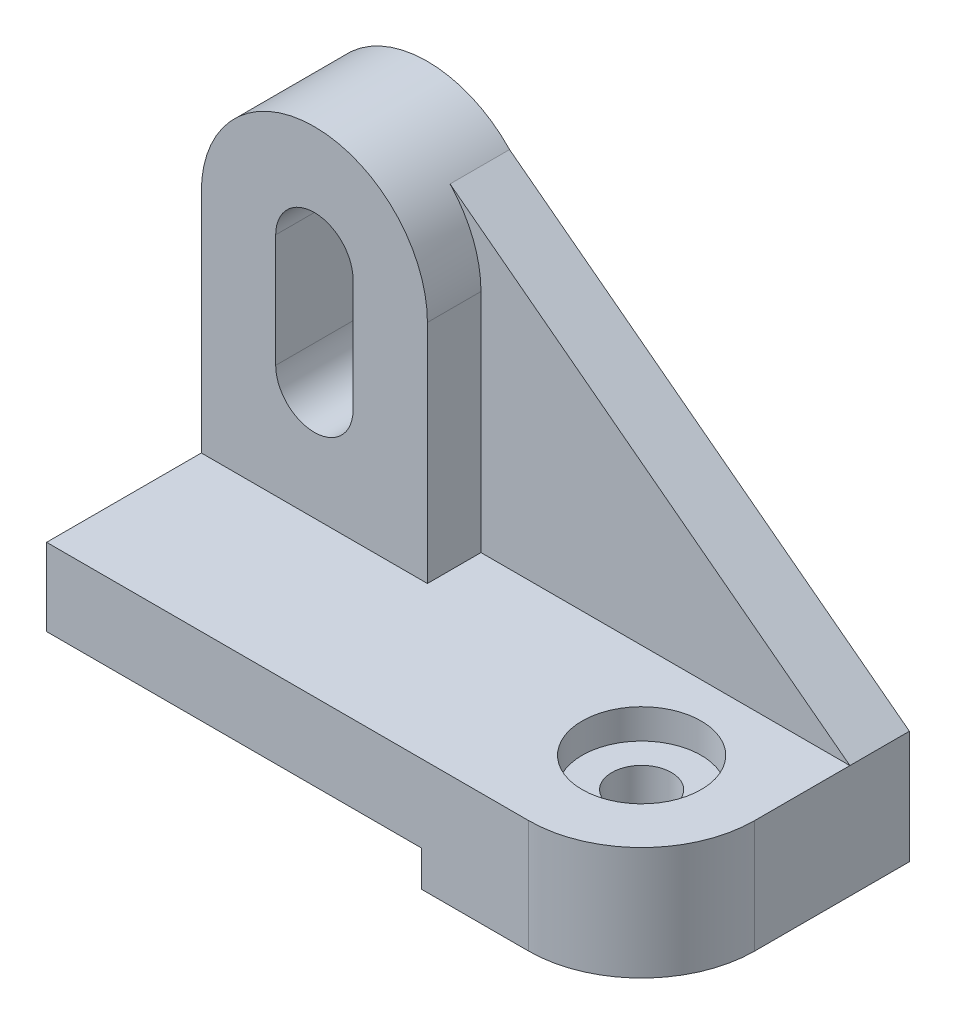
ISO-10303-21;
HEADER;
FILE_DESCRIPTION(('STEP AP214'),'2;1');
FILE_NAME('part.step','',(''),(''),'','','');
FILE_SCHEMA(('AUTOMOTIVE_DESIGN { 1 0 10303 214 1 1 1 1 }'));
ENDSEC;
DATA;
#1=APPLICATION_CONTEXT('core data for automotive mechanical design processes');
#2=APPLICATION_PROTOCOL_DEFINITION('international standard','automotive_design',2000,#1);
#3=PRODUCT_CONTEXT('',#1,'mechanical');
#4=PRODUCT('Part','Part','',(#3));
#5=PRODUCT_RELATED_PRODUCT_CATEGORY('part','',(#4));
#6=PRODUCT_DEFINITION_FORMATION('','',#4);
#7=PRODUCT_DEFINITION_CONTEXT('part definition',#1,'design');
#8=PRODUCT_DEFINITION('design','',#6,#7);
#9=PRODUCT_DEFINITION_SHAPE('','',#8);
#10=(LENGTH_UNIT() NAMED_UNIT(*) SI_UNIT(.MILLI.,.METRE.));
#11=(NAMED_UNIT(*) PLANE_ANGLE_UNIT() SI_UNIT($,.RADIAN.));
#12=(NAMED_UNIT(*) SI_UNIT($,.STERADIAN.) SOLID_ANGLE_UNIT());
#13=UNCERTAINTY_MEASURE_WITH_UNIT(LENGTH_MEASURE(1.E-05),#10,'distance_accuracy_value','');
#14=(GEOMETRIC_REPRESENTATION_CONTEXT(3) GLOBAL_UNCERTAINTY_ASSIGNED_CONTEXT((#13)) GLOBAL_UNIT_ASSIGNED_CONTEXT((#10,
#11,#12)) REPRESENTATION_CONTEXT('',''));
#15=CARTESIAN_POINT('',(0.,0.,0.));
#16=DIRECTION('',(0.,0.,1.));
#17=DIRECTION('',(1.,0.,0.));
#18=AXIS2_PLACEMENT_3D('',#15,#16,#17);
#19=CARTESIAN_POINT('',(0.,130.,450.));
#20=DIRECTION('',(0.,-1.,0.));
#21=DIRECTION('',(0.,0.,-1.));
#22=AXIS2_PLACEMENT_3D('',#19,#20,#21);
#23=PLANE('',#22);
#24=CARTESIAN_POINT('',(810.,130.,260.));
#25=DIRECTION('',(0.,1.,0.));
#26=DIRECTION('',(0.,0.,1.));
#27=AXIS2_PLACEMENT_3D('',#24,#25,#26);
#28=CIRCLE('',#27,100.);
#29=CARTESIAN_POINT('',(810.,130.,360.));
#30=VERTEX_POINT('',#29);
#31=EDGE_CURVE('E303',#30,#30,#28,.T.);
#32=ORIENTED_EDGE('',*,*,#31,.F.);
#33=EDGE_LOOP('',(#32));
#34=FACE_BOUND('',#33,.T.);
#35=DIRECTION('',(1.,0.,0.));
#36=VECTOR('',#35,1.);
#37=CARTESIAN_POINT('',(0.,130.,100.));
#38=LINE('',#37,#36);
#39=CARTESIAN_POINT('',(380.,130.,100.));
#40=VERTEX_POINT('',#39);
#41=CARTESIAN_POINT('',(1000.,130.,100.));
#42=VERTEX_POINT('',#41);
#43=EDGE_CURVE('E156',#40,#42,#38,.T.);
#44=ORIENTED_EDGE('',*,*,#43,.F.);
#45=DIRECTION('',(0.,0.,-1.));
#46=VECTOR('',#45,1.);
#47=CARTESIAN_POINT('',(380.,130.,190.));
#48=LINE('',#47,#46);
#49=CARTESIAN_POINT('',(380.,130.,190.));
#50=VERTEX_POINT('',#49);
#51=EDGE_CURVE('E221',#50,#40,#48,.T.);
#52=ORIENTED_EDGE('',*,*,#51,.F.);
#53=DIRECTION('',(1.,0.,0.));
#54=VECTOR('',#53,1.);
#55=CARTESIAN_POINT('',(0.,130.,190.));
#56=LINE('',#55,#54);
#57=CARTESIAN_POINT('',(0.,130.,190.));
#58=VERTEX_POINT('',#57);
#59=EDGE_CURVE('E70',#58,#50,#56,.T.);
#60=ORIENTED_EDGE('',*,*,#59,.F.);
#61=DIRECTION('',(0.,0.,-1.));
#62=VECTOR('',#61,1.);
#63=CARTESIAN_POINT('',(0.,130.,450.));
#64=LINE('',#63,#62);
#65=CARTESIAN_POINT('',(0.,130.,450.));
#66=VERTEX_POINT('',#65);
#67=EDGE_CURVE('E190',#66,#58,#64,.T.);
#68=ORIENTED_EDGE('',*,*,#67,.F.);
#69=DIRECTION('',(-1.,0.,0.));
#70=VECTOR('',#69,1.);
#71=CARTESIAN_POINT('',(0.,130.,450.));
#72=LINE('',#71,#70);
#73=CARTESIAN_POINT('',(810.,130.,450.));
#74=VERTEX_POINT('',#73);
#75=EDGE_CURVE('E324',#74,#66,#72,.T.);
#76=ORIENTED_EDGE('',*,*,#75,.F.);
#77=CARTESIAN_POINT('',(810.,130.,260.));
#78=DIRECTION('',(0.,-1.,0.));
#79=DIRECTION('',(0.,0.,-1.));
#80=AXIS2_PLACEMENT_3D('',#77,#78,#79);
#81=CIRCLE('',#80,190.);
#82=CARTESIAN_POINT('',(1000.,130.,260.));
#83=VERTEX_POINT('',#82);
#84=EDGE_CURVE('E187',#74,#83,#81,.F.);
#85=ORIENTED_EDGE('',*,*,#84,.T.);
#86=DIRECTION('',(0.,0.,-1.));
#87=VECTOR('',#86,1.);
#88=CARTESIAN_POINT('',(1000.,130.,450.));
#89=LINE('',#88,#87);
#90=EDGE_CURVE('E179',#83,#42,#89,.T.);
#91=ORIENTED_EDGE('',*,*,#90,.T.);
#92=EDGE_LOOP('',(#44,#52,#60,#68,#76,#85,#91));
#93=FACE_BOUND('',#92,.T.);
#94=ADVANCED_FACE('F47',(#34,#93),#23,.F.);
#95=CARTESIAN_POINT('',(380.,0.,190.));
#96=DIRECTION('',(-1.,0.,0.));
#97=DIRECTION('',(0.,0.,1.));
#98=AXIS2_PLACEMENT_3D('',#95,#96,#97);
#99=PLANE('',#98);
#100=DIRECTION('',(0.,-1.,0.));
#101=VECTOR('',#100,1.);
#102=CARTESIAN_POINT('',(380.,0.,100.));
#103=LINE('',#102,#101);
#104=CARTESIAN_POINT('',(380.,510.,100.));
#105=VERTEX_POINT('',#104);
#106=EDGE_CURVE('E159',#105,#40,#103,.T.);
#107=ORIENTED_EDGE('',*,*,#106,.F.);
#108=DIRECTION('',(0.,0.,-1.));
#109=VECTOR('',#108,1.);
#110=CARTESIAN_POINT('',(380.,510.,190.));
#111=LINE('',#110,#109);
#112=CARTESIAN_POINT('',(380.,510.,190.));
#113=VERTEX_POINT('',#112);
#114=EDGE_CURVE('E229',#113,#105,#111,.T.);
#115=ORIENTED_EDGE('',*,*,#114,.F.);
#116=DIRECTION('',(0.,1.,0.));
#117=VECTOR('',#116,1.);
#118=CARTESIAN_POINT('',(380.,0.,190.));
#119=LINE('',#118,#117);
#120=EDGE_CURVE('E259',#50,#113,#119,.T.);
#121=ORIENTED_EDGE('',*,*,#120,.F.);
#122=ORIENTED_EDGE('',*,*,#51,.T.);
#123=EDGE_LOOP('',(#107,#115,#121,#122));
#124=FACE_BOUND('',#123,.T.);
#125=ADVANCED_FACE('F231',(#124),#99,.F.);
#126=CARTESIAN_POINT('',(630.,0.,450.));
#127=DIRECTION('',(0.,1.,0.));
#128=DIRECTION('',(-1.,0.,0.));
#129=AXIS2_PLACEMENT_3D('',#126,#127,#128);
#130=PLANE('',#129);
#131=DIRECTION('',(1.,0.,0.));
#132=VECTOR('',#131,1.);
#133=CARTESIAN_POINT('',(630.,0.,0.));
#134=LINE('',#133,#132);
#135=CARTESIAN_POINT('',(0.,0.,0.));
#136=VERTEX_POINT('',#135);
#137=CARTESIAN_POINT('',(630.,0.,0.));
#138=VERTEX_POINT('',#137);
#139=EDGE_CURVE('E308',#136,#138,#134,.T.);
#140=ORIENTED_EDGE('',*,*,#139,.T.);
#141=DIRECTION('',(0.,0.,-1.));
#142=VECTOR('',#141,1.);
#143=CARTESIAN_POINT('',(630.,0.,450.));
#144=LINE('',#143,#142);
#145=CARTESIAN_POINT('',(630.,0.,450.));
#146=VERTEX_POINT('',#145);
#147=EDGE_CURVE('E202',#146,#138,#144,.T.);
#148=ORIENTED_EDGE('',*,*,#147,.F.);
#149=DIRECTION('',(1.,0.,0.));
#150=VECTOR('',#149,1.);
#151=CARTESIAN_POINT('',(630.,0.,450.));
#152=LINE('',#151,#150);
#153=CARTESIAN_POINT('',(0.,0.,450.));
#154=VERTEX_POINT('',#153);
#155=EDGE_CURVE('E312',#154,#146,#152,.T.);
#156=ORIENTED_EDGE('',*,*,#155,.F.);
#157=DIRECTION('',(0.,0.,-1.));
#158=VECTOR('',#157,1.);
#159=CARTESIAN_POINT('',(0.,0.,450.));
#160=LINE('',#159,#158);
#161=EDGE_CURVE('E196',#154,#136,#160,.T.);
#162=ORIENTED_EDGE('',*,*,#161,.T.);
#163=EDGE_LOOP('',(#140,#148,#156,#162));
#164=FACE_BOUND('',#163,.T.);
#165=ADVANCED_FACE('F349',(#164),#130,.F.);
#166=CARTESIAN_POINT('',(630.,-59.9999999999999,450.));
#167=DIRECTION('',(1.,0.,0.));
#168=DIRECTION('',(0.,0.,-1.));
#169=AXIS2_PLACEMENT_3D('',#166,#167,#168);
#170=PLANE('',#169);
#171=DIRECTION('',(0.,-1.,0.));
#172=VECTOR('',#171,1.);
#173=CARTESIAN_POINT('',(630.,-59.9999999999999,0.));
#174=LINE('',#173,#172);
#175=CARTESIAN_POINT('',(630.,-59.9999999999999,0.));
#176=VERTEX_POINT('',#175);
#177=EDGE_CURVE('E333',#138,#176,#174,.T.);
#178=ORIENTED_EDGE('',*,*,#177,.T.);
#179=DIRECTION('',(0.,0.,-1.));
#180=VECTOR('',#179,1.);
#181=CARTESIAN_POINT('',(630.,-59.9999999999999,450.));
#182=LINE('',#181,#180);
#183=CARTESIAN_POINT('',(630.,-59.9999999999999,450.));
#184=VERTEX_POINT('',#183);
#185=EDGE_CURVE('E194',#184,#176,#182,.T.);
#186=ORIENTED_EDGE('',*,*,#185,.F.);
#187=DIRECTION('',(0.,-1.,0.));
#188=VECTOR('',#187,1.);
#189=CARTESIAN_POINT('',(630.,-59.9999999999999,450.));
#190=LINE('',#189,#188);
#191=EDGE_CURVE('E316',#146,#184,#190,.T.);
#192=ORIENTED_EDGE('',*,*,#191,.F.);
#193=ORIENTED_EDGE('',*,*,#147,.T.);
#194=EDGE_LOOP('',(#178,#186,#192,#193));
#195=FACE_BOUND('',#194,.T.);
#196=ADVANCED_FACE('F363',(#195),#170,.F.);
#197=CARTESIAN_POINT('',(1000.,-59.9999999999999,450.));
#198=DIRECTION('',(0.,1.,0.));
#199=DIRECTION('',(-1.,0.,0.));
#200=AXIS2_PLACEMENT_3D('',#197,#198,#199);
#201=PLANE('',#200);
#202=DIRECTION('',(1.,0.,0.));
#203=VECTOR('',#202,1.);
#204=CARTESIAN_POINT('',(1000.,-59.9999999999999,0.));
#205=LINE('',#204,#203);
#206=CARTESIAN_POINT('',(1000.,-59.9999999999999,0.));
#207=VERTEX_POINT('',#206);
#208=EDGE_CURVE('E337',#176,#207,#205,.T.);
#209=ORIENTED_EDGE('',*,*,#208,.T.);
#210=DIRECTION('',(0.,0.,-1.));
#211=VECTOR('',#210,1.);
#212=CARTESIAN_POINT('',(1000.,-59.9999999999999,450.));
#213=LINE('',#212,#211);
#214=CARTESIAN_POINT('',(1000.,-59.9999999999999,260.));
#215=VERTEX_POINT('',#214);
#216=EDGE_CURVE('E189',#215,#207,#213,.T.);
#217=ORIENTED_EDGE('',*,*,#216,.F.);
#218=CARTESIAN_POINT('',(810.,-59.9999999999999,260.));
#219=DIRECTION('',(0.,1.,0.));
#220=DIRECTION('',(-1.,0.,0.));
#221=AXIS2_PLACEMENT_3D('',#218,#219,#220);
#222=CIRCLE('',#221,190.);
#223=CARTESIAN_POINT('',(810.,-59.9999999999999,450.));
#224=VERTEX_POINT('',#223);
#225=EDGE_CURVE('E214',#215,#224,#222,.F.);
#226=ORIENTED_EDGE('',*,*,#225,.T.);
#227=DIRECTION('',(1.,0.,0.));
#228=VECTOR('',#227,1.);
#229=CARTESIAN_POINT('',(1000.,-59.9999999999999,450.));
#230=LINE('',#229,#228);
#231=EDGE_CURVE('E320',#184,#224,#230,.T.);
#232=ORIENTED_EDGE('',*,*,#231,.F.);
#233=ORIENTED_EDGE('',*,*,#185,.T.);
#234=EDGE_LOOP('',(#209,#217,#226,#232,#233));
#235=FACE_BOUND('',#234,.T.);
#236=CARTESIAN_POINT('',(810.,-59.9999999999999,260.));
#237=DIRECTION('',(0.,1.,0.));
#238=DIRECTION('',(-1.,0.,0.));
#239=AXIS2_PLACEMENT_3D('',#236,#237,#238);
#240=CIRCLE('',#239,50.);
#241=CARTESIAN_POINT('',(760.,-59.9999999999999,260.));
#242=VERTEX_POINT('',#241);
#243=EDGE_CURVE('E220',#242,#242,#240,.F.);
#244=ORIENTED_EDGE('',*,*,#243,.F.);
#245=EDGE_LOOP('',(#244));
#246=FACE_BOUND('',#245,.T.);
#247=ADVANCED_FACE('F395',(#235,#246),#201,.F.);
#248=CARTESIAN_POINT('',(1000.,130.,450.));
#249=DIRECTION('',(-1.,0.,0.));
#250=DIRECTION('',(0.,0.,1.));
#251=AXIS2_PLACEMENT_3D('',#248,#249,#250);
#252=PLANE('',#251);
#253=DIRECTION('',(0.,0.,1.));
#254=VECTOR('',#253,1.);
#255=CARTESIAN_POINT('',(1000.,130.,450.));
#256=LINE('',#255,#254);
#257=CARTESIAN_POINT('',(1000.,130.,0.));
#258=VERTEX_POINT('',#257);
#259=EDGE_CURVE('E163',#42,#258,#256,.F.);
#260=ORIENTED_EDGE('',*,*,#259,.F.);
#261=ORIENTED_EDGE('',*,*,#90,.F.);
#262=DIRECTION('',(0.,1.,0.));
#263=VECTOR('',#262,1.);
#264=CARTESIAN_POINT('',(1000.,130.,260.));
#265=LINE('',#264,#263);
#266=EDGE_CURVE('E211',#83,#215,#265,.F.);
#267=ORIENTED_EDGE('',*,*,#266,.T.);
#268=ORIENTED_EDGE('',*,*,#216,.T.);
#269=DIRECTION('',(0.,1.,0.));
#270=VECTOR('',#269,1.);
#271=CARTESIAN_POINT('',(1000.,130.,0.));
#272=LINE('',#271,#270);
#273=EDGE_CURVE('E182',#207,#258,#272,.T.);
#274=ORIENTED_EDGE('',*,*,#273,.T.);
#275=EDGE_LOOP('',(#260,#261,#267,#268,#274));
#276=FACE_BOUND('',#275,.T.);
#277=ADVANCED_FACE('F178',(#276),#252,.F.);
#278=CARTESIAN_POINT('',(0.,0.,450.));
#279=DIRECTION('',(1.,0.,0.));
#280=DIRECTION('',(0.,0.,-1.));
#281=AXIS2_PLACEMENT_3D('',#278,#279,#280);
#282=PLANE('',#281);
#283=DIRECTION('',(0.,-1.,0.));
#284=VECTOR('',#283,1.);
#285=CARTESIAN_POINT('',(0.,0.,0.));
#286=LINE('',#285,#284);
#287=CARTESIAN_POINT('',(0.,510.,0.));
#288=VERTEX_POINT('',#287);
#289=EDGE_CURVE('E317',#288,#136,#286,.T.);
#290=ORIENTED_EDGE('',*,*,#289,.T.);
#291=ORIENTED_EDGE('',*,*,#161,.F.);
#292=DIRECTION('',(0.,-1.,0.));
#293=VECTOR('',#292,1.);
#294=CARTESIAN_POINT('',(0.,0.,450.));
#295=LINE('',#294,#293);
#296=EDGE_CURVE('E327',#66,#154,#295,.T.);
#297=ORIENTED_EDGE('',*,*,#296,.F.);
#298=ORIENTED_EDGE('',*,*,#67,.T.);
#299=DIRECTION('',(0.,1.,0.));
#300=VECTOR('',#299,1.);
#301=CARTESIAN_POINT('',(0.,0.,190.));
#302=LINE('',#301,#300);
#303=CARTESIAN_POINT('',(0.,510.,190.));
#304=VERTEX_POINT('',#303);
#305=EDGE_CURVE('E252',#58,#304,#302,.T.);
#306=ORIENTED_EDGE('',*,*,#305,.T.);
#307=DIRECTION('',(0.,0.,-1.));
#308=VECTOR('',#307,1.);
#309=CARTESIAN_POINT('',(0.,510.,190.));
#310=LINE('',#309,#308);
#311=EDGE_CURVE('E286',#304,#288,#310,.T.);
#312=ORIENTED_EDGE('',*,*,#311,.T.);
#313=EDGE_LOOP('',(#290,#291,#297,#298,#306,#312));
#314=FACE_BOUND('',#313,.T.);
#315=ADVANCED_FACE('F355',(#314),#282,.F.);
#316=CARTESIAN_POINT('',(0.,0.,450.));
#317=DIRECTION('',(0.,0.,-1.));
#318=DIRECTION('',(-1.,0.,0.));
#319=AXIS2_PLACEMENT_3D('',#316,#317,#318);
#320=PLANE('',#319);
#321=ORIENTED_EDGE('',*,*,#231,.T.);
#322=DIRECTION('',(0.,1.,0.));
#323=VECTOR('',#322,1.);
#324=CARTESIAN_POINT('',(810.,0.,450.));
#325=LINE('',#324,#323);
#326=EDGE_CURVE('E205',#224,#74,#325,.T.);
#327=ORIENTED_EDGE('',*,*,#326,.T.);
#328=ORIENTED_EDGE('',*,*,#75,.T.);
#329=ORIENTED_EDGE('',*,*,#296,.T.);
#330=ORIENTED_EDGE('',*,*,#155,.T.);
#331=ORIENTED_EDGE('',*,*,#191,.T.);
#332=EDGE_LOOP('',(#321,#327,#328,#329,#330,#331));
#333=FACE_BOUND('',#332,.T.);
#334=ADVANCED_FACE('F366',(#333),#320,.F.);
#335=CARTESIAN_POINT('',(0.,0.,0.));
#336=DIRECTION('',(0.,0.,-1.));
#337=DIRECTION('',(-1.,0.,0.));
#338=AXIS2_PLACEMENT_3D('',#335,#336,#337);
#339=PLANE('',#338);
#340=CARTESIAN_POINT('',(190.,510.,0.));
#341=DIRECTION('',(0.,0.,-1.));
#342=DIRECTION('',(-1.,0.,0.));
#343=AXIS2_PLACEMENT_3D('',#340,#341,#342);
#344=CIRCLE('',#343,190.);
#345=CARTESIAN_POINT('',(328.036496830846,640.560045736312,0.));
#346=VERTEX_POINT('',#345);
#347=EDGE_CURVE('E242',#288,#346,#344,.T.);
#348=ORIENTED_EDGE('',*,*,#347,.T.);
#349=DIRECTION('',(-0.796237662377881,0.604983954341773,0.));
#350=VECTOR('',#349,1.);
#351=CARTESIAN_POINT('',(1000.,130.,0.));
#352=LINE('',#351,#350);
#353=EDGE_CURVE('E173',#258,#346,#352,.T.);
#354=ORIENTED_EDGE('',*,*,#353,.F.);
#355=ORIENTED_EDGE('',*,*,#273,.F.);
#356=ORIENTED_EDGE('',*,*,#208,.F.);
#357=ORIENTED_EDGE('',*,*,#177,.F.);
#358=ORIENTED_EDGE('',*,*,#139,.F.);
#359=ORIENTED_EDGE('',*,*,#289,.F.);
#360=EDGE_LOOP('',(#348,#354,#355,#356,#357,#358,#359));
#361=FACE_BOUND('',#360,.T.);
#362=CARTESIAN_POINT('',(190.,320.,0.));
#363=DIRECTION('',(0.,0.,-1.));
#364=DIRECTION('',(-1.,0.,0.));
#365=AXIS2_PLACEMENT_3D('',#362,#363,#364);
#366=CIRCLE('',#365,65.);
#367=CARTESIAN_POINT('',(255.,320.,0.));
#368=VERTEX_POINT('',#367);
#369=CARTESIAN_POINT('',(125.,320.,0.));
#370=VERTEX_POINT('',#369);
#371=EDGE_CURVE('E184',#368,#370,#366,.T.);
#372=ORIENTED_EDGE('',*,*,#371,.F.);
#373=DIRECTION('',(0.,-1.,0.));
#374=VECTOR('',#373,1.);
#375=CARTESIAN_POINT('',(255.,0.,0.));
#376=LINE('',#375,#374);
#377=CARTESIAN_POINT('',(255.,510.,0.));
#378=VERTEX_POINT('',#377);
#379=EDGE_CURVE('E268',#378,#368,#376,.T.);
#380=ORIENTED_EDGE('',*,*,#379,.F.);
#381=CARTESIAN_POINT('',(190.,510.,0.));
#382=DIRECTION('',(0.,0.,-1.));
#383=DIRECTION('',(-1.,0.,0.));
#384=AXIS2_PLACEMENT_3D('',#381,#382,#383);
#385=CIRCLE('',#384,65.);
#386=CARTESIAN_POINT('',(125.,510.,0.));
#387=VERTEX_POINT('',#386);
#388=EDGE_CURVE('E272',#387,#378,#385,.T.);
#389=ORIENTED_EDGE('',*,*,#388,.F.);
#390=DIRECTION('',(0.,-1.,0.));
#391=VECTOR('',#390,1.);
#392=CARTESIAN_POINT('',(125.,0.,0.));
#393=LINE('',#392,#391);
#394=EDGE_CURVE('E276',#387,#370,#393,.T.);
#395=ORIENTED_EDGE('',*,*,#394,.T.);
#396=EDGE_LOOP('',(#372,#380,#389,#395));
#397=FACE_BOUND('',#396,.T.);
#398=ADVANCED_FACE('F358',(#361,#397),#339,.T.);
#399=CARTESIAN_POINT('',(810.,0.,260.));
#400=DIRECTION('',(0.,1.,0.));
#401=DIRECTION('',(0.,0.,1.));
#402=AXIS2_PLACEMENT_3D('',#399,#400,#401);
#403=CYLINDRICAL_SURFACE('',#402,190.);
#404=ORIENTED_EDGE('',*,*,#225,.F.);
#405=ORIENTED_EDGE('',*,*,#266,.F.);
#406=ORIENTED_EDGE('',*,*,#84,.F.);
#407=ORIENTED_EDGE('',*,*,#326,.F.);
#408=EDGE_LOOP('',(#404,#405,#406,#407));
#409=FACE_BOUND('',#408,.T.);
#410=ADVANCED_FACE('F49',(#409),#403,.T.);
#411=CARTESIAN_POINT('',(810.,80.,260.));
#412=DIRECTION('',(0.,1.,0.));
#413=DIRECTION('',(0.,0.,1.));
#414=AXIS2_PLACEMENT_3D('',#411,#412,#413);
#415=CYLINDRICAL_SURFACE('',#414,100.);
#416=CARTESIAN_POINT('',(810.,80.,260.));
#417=DIRECTION('',(0.,1.,0.));
#418=DIRECTION('',(0.,0.,1.));
#419=AXIS2_PLACEMENT_3D('',#416,#417,#418);
#420=CIRCLE('',#419,100.);
#421=CARTESIAN_POINT('',(810.,80.,360.));
#422=VERTEX_POINT('',#421);
#423=EDGE_CURVE('E304',#422,#422,#420,.T.);
#424=ORIENTED_EDGE('',*,*,#423,.F.);
#425=EDGE_LOOP('',(#424));
#426=FACE_BOUND('',#425,.T.);
#427=ORIENTED_EDGE('',*,*,#31,.T.);
#428=EDGE_LOOP('',(#427));
#429=FACE_BOUND('',#428,.T.);
#430=ADVANCED_FACE('F440',(#426,#429),#415,.F.);
#431=CARTESIAN_POINT('',(810.,80.,260.));
#432=DIRECTION('',(0.,1.,0.));
#433=DIRECTION('',(0.,0.,1.));
#434=AXIS2_PLACEMENT_3D('',#431,#432,#433);
#435=PLANE('',#434);
#436=CARTESIAN_POINT('',(810.,80.,260.));
#437=DIRECTION('',(0.,1.,0.));
#438=DIRECTION('',(0.,0.,1.));
#439=AXIS2_PLACEMENT_3D('',#436,#437,#438);
#440=CIRCLE('',#439,50.);
#441=CARTESIAN_POINT('',(810.,80.,310.));
#442=VERTEX_POINT('',#441);
#443=EDGE_CURVE('E217',#442,#442,#440,.F.);
#444=ORIENTED_EDGE('',*,*,#443,.T.);
#445=EDGE_LOOP('',(#444));
#446=FACE_BOUND('',#445,.T.);
#447=ORIENTED_EDGE('',*,*,#423,.T.);
#448=EDGE_LOOP('',(#447));
#449=FACE_BOUND('',#448,.T.);
#450=ADVANCED_FACE('F447',(#446,#449),#435,.T.);
#451=CARTESIAN_POINT('',(810.,389.,260.));
#452=DIRECTION('',(0.,-1.,0.));
#453=DIRECTION('',(0.,0.,-1.));
#454=AXIS2_PLACEMENT_3D('',#451,#452,#453);
#455=CYLINDRICAL_SURFACE('',#454,50.);
#456=ORIENTED_EDGE('',*,*,#443,.F.);
#457=EDGE_LOOP('',(#456));
#458=FACE_BOUND('',#457,.T.);
#459=ORIENTED_EDGE('',*,*,#243,.T.);
#460=EDGE_LOOP('',(#459));
#461=FACE_BOUND('',#460,.T.);
#462=ADVANCED_FACE('F455',(#458,#461),#455,.F.);
#463=CARTESIAN_POINT('',(190.,320.,190.));
#464=DIRECTION('',(0.,0.,-1.));
#465=DIRECTION('',(-1.,0.,0.));
#466=AXIS2_PLACEMENT_3D('',#463,#464,#465);
#467=CYLINDRICAL_SURFACE('',#466,65.);
#468=ORIENTED_EDGE('',*,*,#371,.T.);
#469=DIRECTION('',(0.,0.,-1.));
#470=VECTOR('',#469,1.);
#471=CARTESIAN_POINT('',(125.,320.,190.));
#472=LINE('',#471,#470);
#473=CARTESIAN_POINT('',(125.,320.,190.));
#474=VERTEX_POINT('',#473);
#475=EDGE_CURVE('E289',#474,#370,#472,.T.);
#476=ORIENTED_EDGE('',*,*,#475,.F.);
#477=CARTESIAN_POINT('',(190.,320.,190.));
#478=DIRECTION('',(0.,0.,-1.));
#479=DIRECTION('',(-1.,0.,0.));
#480=AXIS2_PLACEMENT_3D('',#477,#478,#479);
#481=CIRCLE('',#480,65.);
#482=CARTESIAN_POINT('',(255.,320.,190.));
#483=VERTEX_POINT('',#482);
#484=EDGE_CURVE('E238',#483,#474,#481,.T.);
#485=ORIENTED_EDGE('',*,*,#484,.F.);
#486=DIRECTION('',(0.,0.,-1.));
#487=VECTOR('',#486,1.);
#488=CARTESIAN_POINT('',(255.,320.,190.));
#489=LINE('',#488,#487);
#490=EDGE_CURVE('E264',#483,#368,#489,.T.);
#491=ORIENTED_EDGE('',*,*,#490,.T.);
#492=EDGE_LOOP('',(#468,#476,#485,#491));
#493=FACE_BOUND('',#492,.T.);
#494=ADVANCED_FACE('F463',(#493),#467,.F.);
#495=CARTESIAN_POINT('',(125.,0.,190.));
#496=DIRECTION('',(1.,0.,0.));
#497=DIRECTION('',(0.,1.,0.));
#498=AXIS2_PLACEMENT_3D('',#495,#496,#497);
#499=PLANE('',#498);
#500=ORIENTED_EDGE('',*,*,#394,.F.);
#501=DIRECTION('',(0.,0.,-1.));
#502=VECTOR('',#501,1.);
#503=CARTESIAN_POINT('',(125.,510.,190.));
#504=LINE('',#503,#502);
#505=CARTESIAN_POINT('',(125.,510.,190.));
#506=VERTEX_POINT('',#505);
#507=EDGE_CURVE('E292',#506,#387,#504,.T.);
#508=ORIENTED_EDGE('',*,*,#507,.F.);
#509=DIRECTION('',(0.,-1.,0.));
#510=VECTOR('',#509,1.);
#511=CARTESIAN_POINT('',(125.,0.,190.));
#512=LINE('',#511,#510);
#513=EDGE_CURVE('E248',#506,#474,#512,.T.);
#514=ORIENTED_EDGE('',*,*,#513,.T.);
#515=ORIENTED_EDGE('',*,*,#475,.T.);
#516=EDGE_LOOP('',(#500,#508,#514,#515));
#517=FACE_BOUND('',#516,.T.);
#518=ADVANCED_FACE('F470',(#517),#499,.T.);
#519=CARTESIAN_POINT('',(190.,510.,190.));
#520=DIRECTION('',(0.,0.,-1.));
#521=DIRECTION('',(-1.,0.,0.));
#522=AXIS2_PLACEMENT_3D('',#519,#520,#521);
#523=CYLINDRICAL_SURFACE('',#522,65.);
#524=ORIENTED_EDGE('',*,*,#388,.T.);
#525=DIRECTION('',(0.,0.,-1.));
#526=VECTOR('',#525,1.);
#527=CARTESIAN_POINT('',(255.,510.,190.));
#528=LINE('',#527,#526);
#529=CARTESIAN_POINT('',(255.,510.,190.));
#530=VERTEX_POINT('',#529);
#531=EDGE_CURVE('E295',#530,#378,#528,.T.);
#532=ORIENTED_EDGE('',*,*,#531,.F.);
#533=CARTESIAN_POINT('',(190.,510.,190.));
#534=DIRECTION('',(0.,0.,-1.));
#535=DIRECTION('',(-1.,0.,0.));
#536=AXIS2_PLACEMENT_3D('',#533,#534,#535);
#537=CIRCLE('',#536,65.);
#538=EDGE_CURVE('E245',#506,#530,#537,.T.);
#539=ORIENTED_EDGE('',*,*,#538,.F.);
#540=ORIENTED_EDGE('',*,*,#507,.T.);
#541=EDGE_LOOP('',(#524,#532,#539,#540));
#542=FACE_BOUND('',#541,.T.);
#543=ADVANCED_FACE('F478',(#542),#523,.F.);
#544=CARTESIAN_POINT('',(255.,0.,190.));
#545=DIRECTION('',(1.,0.,0.));
#546=DIRECTION('',(0.,0.,-1.));
#547=AXIS2_PLACEMENT_3D('',#544,#545,#546);
#548=PLANE('',#547);
#549=ORIENTED_EDGE('',*,*,#379,.T.);
#550=ORIENTED_EDGE('',*,*,#490,.F.);
#551=DIRECTION('',(0.,-1.,0.));
#552=VECTOR('',#551,1.);
#553=CARTESIAN_POINT('',(255.,0.,190.));
#554=LINE('',#553,#552);
#555=EDGE_CURVE('E241',#530,#483,#554,.T.);
#556=ORIENTED_EDGE('',*,*,#555,.F.);
#557=ORIENTED_EDGE('',*,*,#531,.T.);
#558=EDGE_LOOP('',(#549,#550,#556,#557));
#559=FACE_BOUND('',#558,.T.);
#560=ADVANCED_FACE('F379',(#559),#548,.F.);
#561=CARTESIAN_POINT('',(190.,510.,190.));
#562=DIRECTION('',(0.,0.,-1.));
#563=DIRECTION('',(-1.,0.,0.));
#564=AXIS2_PLACEMENT_3D('',#561,#562,#563);
#565=CYLINDRICAL_SURFACE('',#564,190.);
#566=DIRECTION('',(0.,0.,-1.));
#567=VECTOR('',#566,1.);
#568=CARTESIAN_POINT('',(328.036496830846,640.560045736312,190.));
#569=LINE('',#568,#567);
#570=CARTESIAN_POINT('',(328.036496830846,640.560045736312,100.));
#571=VERTEX_POINT('',#570);
#572=EDGE_CURVE('E11',#346,#571,#569,.F.);
#573=ORIENTED_EDGE('',*,*,#572,.F.);
#574=ORIENTED_EDGE('',*,*,#347,.F.);
#575=ORIENTED_EDGE('',*,*,#311,.F.);
#576=CARTESIAN_POINT('',(190.,510.,190.));
#577=DIRECTION('',(0.,0.,-1.));
#578=DIRECTION('',(-1.,0.,0.));
#579=AXIS2_PLACEMENT_3D('',#576,#577,#578);
#580=CIRCLE('',#579,190.);
#581=EDGE_CURVE('E256',#304,#113,#580,.T.);
#582=ORIENTED_EDGE('',*,*,#581,.T.);
#583=ORIENTED_EDGE('',*,*,#114,.T.);
#584=CARTESIAN_POINT('',(190.,510.,100.));
#585=DIRECTION('',(0.,0.,-1.));
#586=DIRECTION('',(-1.,0.,0.));
#587=AXIS2_PLACEMENT_3D('',#584,#585,#586);
#588=CIRCLE('',#587,190.);
#589=EDGE_CURVE('E56',#105,#571,#588,.F.);
#590=ORIENTED_EDGE('',*,*,#589,.T.);
#591=EDGE_LOOP('',(#573,#574,#575,#582,#583,#590));
#592=FACE_BOUND('',#591,.T.);
#593=ADVANCED_FACE('F225',(#592),#565,.T.);
#594=CARTESIAN_POINT('',(0.,0.,190.));
#595=DIRECTION('',(0.,0.,-1.));
#596=DIRECTION('',(-1.,0.,0.));
#597=AXIS2_PLACEMENT_3D('',#594,#595,#596);
#598=PLANE('',#597);
#599=ORIENTED_EDGE('',*,*,#484,.T.);
#600=ORIENTED_EDGE('',*,*,#513,.F.);
#601=ORIENTED_EDGE('',*,*,#538,.T.);
#602=ORIENTED_EDGE('',*,*,#555,.T.);
#603=EDGE_LOOP('',(#599,#600,#601,#602));
#604=FACE_BOUND('',#603,.T.);
#605=ORIENTED_EDGE('',*,*,#305,.F.);
#606=ORIENTED_EDGE('',*,*,#59,.T.);
#607=ORIENTED_EDGE('',*,*,#120,.T.);
#608=ORIENTED_EDGE('',*,*,#581,.F.);
#609=EDGE_LOOP('',(#605,#606,#607,#608));
#610=FACE_BOUND('',#609,.T.);
#611=ADVANCED_FACE('F370',(#604,#610),#598,.F.);
#612=CARTESIAN_POINT('',(500.,320.,100.));
#613=DIRECTION('',(0.,0.,-1.));
#614=DIRECTION('',(-1.,0.,0.));
#615=AXIS2_PLACEMENT_3D('',#612,#613,#614);
#616=PLANE('',#615);
#617=ORIENTED_EDGE('',*,*,#106,.T.);
#618=ORIENTED_EDGE('',*,*,#43,.T.);
#619=DIRECTION('',(-0.796237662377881,0.604983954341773,0.));
#620=VECTOR('',#619,1.);
#621=CARTESIAN_POINT('',(1000.,130.,100.));
#622=LINE('',#621,#620);
#623=EDGE_CURVE('E63',#42,#571,#622,.T.);
#624=ORIENTED_EDGE('',*,*,#623,.T.);
#625=ORIENTED_EDGE('',*,*,#589,.F.);
#626=EDGE_LOOP('',(#617,#618,#624,#625));
#627=FACE_BOUND('',#626,.T.);
#628=ADVANCED_FACE('F157',(#627),#616,.F.);
#629=CARTESIAN_POINT('',(1000.,130.,0.));
#630=DIRECTION('',(-0.604983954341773,-0.796237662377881,0.));
#631=DIRECTION('',(-0.796237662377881,0.604983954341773,0.));
#632=AXIS2_PLACEMENT_3D('',#629,#630,#631);
#633=PLANE('',#632);
#634=ORIENTED_EDGE('',*,*,#623,.F.);
#635=ORIENTED_EDGE('',*,*,#259,.T.);
#636=ORIENTED_EDGE('',*,*,#353,.T.);
#637=ORIENTED_EDGE('',*,*,#572,.T.);
#638=EDGE_LOOP('',(#634,#635,#636,#637));
#639=FACE_BOUND('',#638,.T.);
#640=ADVANCED_FACE('F167',(#639),#633,.F.);
#641=CLOSED_SHELL('',(#94,#125,#165,#196,#247,#277,#315,#334,#398,#410,#430,#450,#462,#494,#518,
#543,#560,#593,#611,#628,#640));
#642=MANIFOLD_SOLID_BREP('B2',#641);
#643=ADVANCED_BREP_SHAPE_REPRESENTATION('',(#18,#642),#14);
#644=SHAPE_DEFINITION_REPRESENTATION(#9,#643);
ENDSEC;
END-ISO-10303-21;
